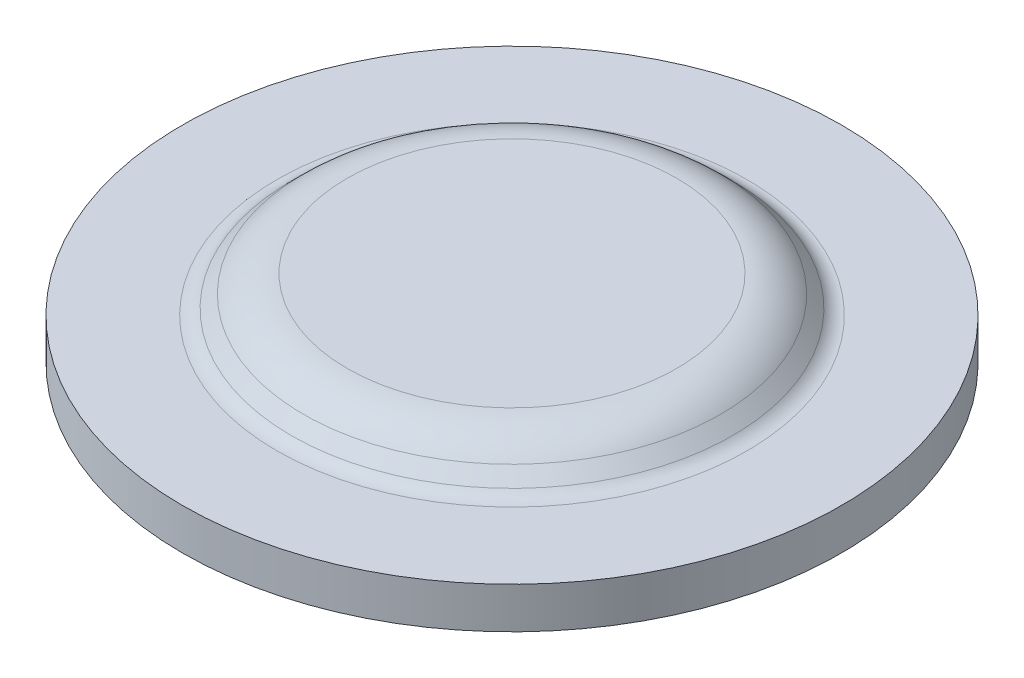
ISO-10303-21;
HEADER;
FILE_DESCRIPTION(('STEP AP214'),'2;1');
FILE_NAME('part.step','',(''),(''),'','','');
FILE_SCHEMA(('AUTOMOTIVE_DESIGN { 1 0 10303 214 1 1 1 1 }'));
ENDSEC;
DATA;
#1=APPLICATION_CONTEXT('core data for automotive mechanical design processes');
#2=APPLICATION_PROTOCOL_DEFINITION('international standard','automotive_design',2000,#1);
#3=PRODUCT_CONTEXT('',#1,'mechanical');
#4=PRODUCT('Part','Part','',(#3));
#5=PRODUCT_RELATED_PRODUCT_CATEGORY('part','',(#4));
#6=PRODUCT_DEFINITION_FORMATION('','',#4);
#7=PRODUCT_DEFINITION_CONTEXT('part definition',#1,'design');
#8=PRODUCT_DEFINITION('design','',#6,#7);
#9=PRODUCT_DEFINITION_SHAPE('','',#8);
#10=(LENGTH_UNIT() NAMED_UNIT(*) SI_UNIT(.MILLI.,.METRE.));
#11=(NAMED_UNIT(*) PLANE_ANGLE_UNIT() SI_UNIT($,.RADIAN.));
#12=(NAMED_UNIT(*) SI_UNIT($,.STERADIAN.) SOLID_ANGLE_UNIT());
#13=UNCERTAINTY_MEASURE_WITH_UNIT(LENGTH_MEASURE(1.E-05),#10,'distance_accuracy_value','');
#14=(GEOMETRIC_REPRESENTATION_CONTEXT(3) GLOBAL_UNCERTAINTY_ASSIGNED_CONTEXT((#13)) GLOBAL_UNIT_ASSIGNED_CONTEXT((#10,
#11,#12)) REPRESENTATION_CONTEXT('',''));
#15=CARTESIAN_POINT('',(0.,0.,0.));
#16=DIRECTION('',(0.,0.,1.));
#17=DIRECTION('',(1.,0.,0.));
#18=AXIS2_PLACEMENT_3D('',#15,#16,#17);
#19=CARTESIAN_POINT('',(0.,0.,0.));
#20=DIRECTION('',(0.,-1.,0.));
#21=DIRECTION('',(0.,0.,-1.));
#22=AXIS2_PLACEMENT_3D('',#19,#20,#21);
#23=PLANE('',#22);
#24=CARTESIAN_POINT('',(0.,0.,0.));
#25=DIRECTION('',(0.,1.,0.));
#26=DIRECTION('',(-1.,0.,0.));
#27=AXIS2_PLACEMENT_3D('',#24,#25,#26);
#28=CIRCLE('',#27,12.7);
#29=CARTESIAN_POINT('',(0.,0.,-12.7));
#30=VERTEX_POINT('',#29);
#31=CARTESIAN_POINT('',(0.,0.,12.7));
#32=VERTEX_POINT('',#31);
#33=EDGE_CURVE('E23',#30,#32,#28,.F.);
#34=ORIENTED_EDGE('',*,*,#33,.F.);
#35=CARTESIAN_POINT('',(0.,0.,12.7));
#36=CARTESIAN_POINT('',(-0.184824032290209,-3.84965216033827E-09,12.7000244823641));
#37=CARTESIAN_POINT('',(-0.36963106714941,-1.68045533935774E-09,12.6959965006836));
#38=CARTESIAN_POINT('',(-0.738898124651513,9.47294713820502E-10,12.6799204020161));
#39=CARTESIAN_POINT('',(-0.923358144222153,1.40583287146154E-09,12.667872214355));
#40=CARTESIAN_POINT('',(-1.33764169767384,-1.4954067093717E-08,12.6318369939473));
#41=CARTESIAN_POINT('',(-1.56727870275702,-3.61199058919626E-08,12.6056184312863));
#42=CARTESIAN_POINT('',(-1.88459083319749,-4.27500474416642E-08,12.5603596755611));
#43=CARTESIAN_POINT('',(-1.97307076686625,-4.21408398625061E-08,12.5467582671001));
#44=CARTESIAN_POINT('',(-2.26868301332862,-3.46277801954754E-08,12.4980667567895));
#45=CARTESIAN_POINT('',(-2.47512819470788,-2.03514395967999E-08,12.458706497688));
#46=CARTESIAN_POINT('',(-2.91330756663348,-2.42009717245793E-09,12.3638436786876));
#47=CARTESIAN_POINT('',(-3.1447285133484,-4.42313466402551E-10,12.3068857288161));
#48=CARTESIAN_POINT('',(-3.43502549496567,2.44823947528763E-11,12.2268096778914));
#49=CARTESIAN_POINT('',(-3.49557710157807,9.72734467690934E-12,12.2096267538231));
#50=CARTESIAN_POINT('',(-3.66844496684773,-1.81121848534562E-11,12.1591972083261));
#51=CARTESIAN_POINT('',(-3.78044419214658,-1.88209919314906E-11,12.124857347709));
#52=CARTESIAN_POINT('',(-4.11494347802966,-5.82007553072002E-11,12.0171976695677));
#53=CARTESIAN_POINT('',(-4.33596647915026,-1.34118184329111E-10,11.9392321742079));
#54=CARTESIAN_POINT('',(-4.77335162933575,-2.65208325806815E-10,11.7712032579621));
#55=CARTESIAN_POINT('',(-4.98971377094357,-3.20381005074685E-10,11.6811398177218));
#56=CARTESIAN_POINT('',(-5.4171260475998,-3.89526845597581E-10,11.4891770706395));
#57=CARTESIAN_POINT('',(-5.62817617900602,-4.03499978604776E-10,11.3872777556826));
#58=CARTESIAN_POINT('',(-6.04431517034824,-3.7917256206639E-10,11.1719584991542));
#59=CARTESIAN_POINT('',(-6.24940403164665,-3.40872024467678E-10,11.0585385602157));
#60=CARTESIAN_POINT('',(-6.65299016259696,-2.34154174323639E-10,10.8205275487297));
#61=CARTESIAN_POINT('',(-6.85148743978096,-1.65736896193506E-10,10.6959364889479));
#62=CARTESIAN_POINT('',(-7.24129202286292,-4.90150512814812E-11,10.4359543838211));
#63=CARTESIAN_POINT('',(-7.43259934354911,-7.10443129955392E-13,10.3005633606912));
#64=CARTESIAN_POINT('',(-7.72922997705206,4.08603384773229E-13,10.0780700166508));
#65=CARTESIAN_POINT('',(-7.83713271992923,-1.53499500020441E-11,9.99438280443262));
#66=CARTESIAN_POINT('',(-8.05018994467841,-3.35935319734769E-11,9.82357444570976));
#67=CARTESIAN_POINT('',(-8.15534442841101,-3.60785695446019E-11,9.73645330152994));
#68=CARTESIAN_POINT('',(-8.36279163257,-2.46835874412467E-11,9.55886880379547));
#69=CARTESIAN_POINT('',(-8.46508435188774,-1.08035614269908E-11,9.46840544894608));
#70=CARTESIAN_POINT('',(-8.66670151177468,5.04949516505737E-12,9.28423122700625));
#71=CARTESIAN_POINT('',(-8.76602594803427,7.0225084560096E-12,9.19052035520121));
#72=CARTESIAN_POINT('',(-8.98116596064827,-1.01463956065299E-10,8.98088773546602));
#73=CARTESIAN_POINT('',(-9.09630723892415,-2.34486653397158E-10,8.86427195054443));
#74=CARTESIAN_POINT('',(-9.28977013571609,-6.71658310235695E-10,8.66059653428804));
#75=CARTESIAN_POINT('',(-9.36921913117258,-9.16112779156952E-10,8.57460328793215));
#76=CARTESIAN_POINT('',(-9.54526865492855,-1.44522386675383E-09,8.37867868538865));
#77=CARTESIAN_POINT('',(-9.64119193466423,-1.72465418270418E-09,8.26813701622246));
#78=CARTESIAN_POINT('',(-9.82915599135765,-2.17631259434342E-09,8.04380283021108));
#79=CARTESIAN_POINT('',(-9.92119676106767,-2.3485404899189E-09,7.93001030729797));
#80=CARTESIAN_POINT('',(-10.1012868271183,-2.52647142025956E-09,7.69930866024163));
#81=CARTESIAN_POINT('',(-10.1893361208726,-2.53217434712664E-09,7.58239953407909));
#82=CARTESIAN_POINT('',(-10.3613374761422,-2.37841325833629E-09,7.34560540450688));
#83=CARTESIAN_POINT('',(-10.4452895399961,-2.21894933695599E-09,7.22572040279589));
#84=CARTESIAN_POINT('',(-10.6089954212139,-1.77789731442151E-09,6.98311781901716));
#85=CARTESIAN_POINT('',(-10.6887492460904,-1.4963094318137E-09,6.86040024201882));
#86=CARTESIAN_POINT('',(-10.8439649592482,-9.29882612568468E-10,6.61228047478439));
#87=CARTESIAN_POINT('',(-10.9194268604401,-6.45043685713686E-10,6.4868782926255));
#88=CARTESIAN_POINT('',(-11.0659612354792,-1.49235200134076E-10,6.23353643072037));
#89=CARTESIAN_POINT('',(-11.1370337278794,6.17346708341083E-11,6.10559676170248));
#90=CARTESIAN_POINT('',(-11.2797927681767,-6.62806330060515E-11,5.83785098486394));
#91=CARTESIAN_POINT('',(-11.3511402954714,-4.46839166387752E-10,5.69786399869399));
#92=CARTESIAN_POINT('',(-11.4972078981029,4.17609017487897E-10,5.39769478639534));
#93=CARTESIAN_POINT('',(-11.5712349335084,1.8717342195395E-09,5.23717525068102));
#94=CARTESIAN_POINT('',(-11.7126344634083,-3.55651405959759E-09,4.91321954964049));
#95=CARTESIAN_POINT('',(-11.7800068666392,-1.04390018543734E-08,4.7497833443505));
#96=CARTESIAN_POINT('',(-11.8731237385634,-1.26514081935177E-08,4.50937135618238));
#97=CARTESIAN_POINT('',(-11.9016656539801,-1.2217502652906E-08,4.43346857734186));
#98=CARTESIAN_POINT('',(-11.9890652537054,-9.48539449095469E-09,4.19404982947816));
#99=CARTESIAN_POINT('',(-12.0452833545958,-5.6231270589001E-09,4.02955988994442));
#100=CARTESIAN_POINT('',(-12.145707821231,-1.25640466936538E-09,3.7147667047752));
#101=CARTESIAN_POINT('',(-12.1905521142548,-4.58078057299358E-10,3.56466621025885));
#102=CARTESIAN_POINT('',(-12.2592720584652,1.40692521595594E-11,3.31821778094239));
#103=CARTESIAN_POINT('',(-12.2848095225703,-7.22942656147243E-12,3.2223295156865));
#104=CARTESIAN_POINT('',(-12.3590516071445,1.47379253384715E-11,2.92994959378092));
#105=CARTESIAN_POINT('',(-12.4042269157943,1.48194567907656E-10,2.73254920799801));
#106=CARTESIAN_POINT('',(-12.4851083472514,-1.23484726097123E-09,2.33581239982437));
#107=CARTESIAN_POINT('',(-12.5208143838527,-2.75136075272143E-09,2.13647595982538));
#108=CARTESIAN_POINT('',(-12.561024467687,-6.87540143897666E-09,1.87640153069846));
#109=CARTESIAN_POINT('',(-12.5698744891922,-7.9762197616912E-09,1.81631544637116));
#110=CARTESIAN_POINT('',(-12.5867245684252,-1.16176603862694E-08,1.69602269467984));
#111=CARTESIAN_POINT('',(-12.5947246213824,-1.41582907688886E-08,1.63581602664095));
#112=CARTESIAN_POINT('',(-12.6132680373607,-1.69818757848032E-08,1.48779986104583));
#113=CARTESIAN_POINT('',(-12.6233068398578,-1.57062613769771E-08,1.39992726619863));
#114=CARTESIAN_POINT('',(-12.650384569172,-1.1091843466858E-08,1.13859690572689));
#115=CARTESIAN_POINT('',(-12.6647599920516,-6.95224022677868E-09,0.964856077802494));
#116=CARTESIAN_POINT('',(-12.6855624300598,-1.83494198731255E-09,0.629530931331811));
#117=CARTESIAN_POINT('',(-12.6924895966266,-6.50006501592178E-10,0.46797727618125));
#118=CARTESIAN_POINT('',(-12.698789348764,4.787543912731E-11,0.204255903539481));
#119=CARTESIAN_POINT('',(-12.7000045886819,1.58644500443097E-11,0.102128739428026));
#120=CARTESIAN_POINT('',(-12.6999942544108,-1.98720390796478E-11,-0.127877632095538));
#121=CARTESIAN_POINT('',(-12.6980760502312,-1.4431354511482E-11,-0.255757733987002));
#122=CARTESIAN_POINT('',(-12.6903676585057,-3.81394548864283E-11,-0.511400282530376));
#123=CARTESIAN_POINT('',(-12.684577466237,-6.72882820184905E-11,-0.63916272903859));
#124=CARTESIAN_POINT('',(-12.6691434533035,-1.34810511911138E-10,-0.894454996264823));
#125=CARTESIAN_POINT('',(-12.6594996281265,-1.73183925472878E-10,-1.02198481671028));
#126=CARTESIAN_POINT('',(-12.6363636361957,-2.63522351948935E-10,-1.27669501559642));
#127=CARTESIAN_POINT('',(-12.6228714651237,-3.15487380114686E-10,-1.40387539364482));
#128=CARTESIAN_POINT('',(-12.5920520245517,-4.29510494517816E-10,-1.65777076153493));
#129=CARTESIAN_POINT('',(-12.5747247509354,-4.91568591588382E-10,-1.78448575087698));
#130=CARTESIAN_POINT('',(-12.5362506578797,-6.24490110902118E-10,-2.03733467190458));
#131=CARTESIAN_POINT('',(-12.515103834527,-6.95353542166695E-10,-2.16346860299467));
#132=CARTESIAN_POINT('',(-12.4690099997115,-8.44107797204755E-10,-2.41504030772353));
#133=CARTESIAN_POINT('',(-12.4440629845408,-9.21998627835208E-10,-2.54047808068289));
#134=CARTESIAN_POINT('',(-12.3903915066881,-1.08326372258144E-09,-2.79054299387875));
#135=CARTESIAN_POINT('',(-12.3616670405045,-1.16663799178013E-09,-2.91517013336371));
#136=CARTESIAN_POINT('',(-12.300466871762,-1.33736603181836E-09,-3.16350004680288));
#137=CARTESIAN_POINT('',(-12.2679911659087,-1.42471980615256E-09,-3.28720281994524));
#138=CARTESIAN_POINT('',(-12.1993181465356,-1.60199456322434E-09,-3.53357111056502));
#139=CARTESIAN_POINT('',(-12.163120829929,-1.69191554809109E-09,-3.65623662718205));
#140=CARTESIAN_POINT('',(-12.0870376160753,-1.87298983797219E-09,-3.90041846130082));
#141=CARTESIAN_POINT('',(-12.0471517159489,-1.96414314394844E-09,-4.02193477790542));
#142=CARTESIAN_POINT('',(-11.9637277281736,-2.14642991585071E-09,-4.26370731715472));
#143=CARTESIAN_POINT('',(-11.920189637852,-2.23756338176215E-09,-4.3839635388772));
#144=CARTESIAN_POINT('',(-11.8295009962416,-2.41863745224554E-09,-4.62310614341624));
#145=CARTESIAN_POINT('',(-11.7823504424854,-2.50857805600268E-09,-4.74199252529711));
#146=CARTESIAN_POINT('',(-11.6844798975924,-2.68617634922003E-09,-4.97828695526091));
#147=CARTESIAN_POINT('',(-11.6337599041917,-2.77383403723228E-09,-5.09569500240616));
#148=CARTESIAN_POINT('',(-11.5287967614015,-2.94585462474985E-09,-5.32892561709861));
#149=CARTESIAN_POINT('',(-11.4745536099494,-3.03021752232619E-09,-5.44474818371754));
#150=CARTESIAN_POINT('',(-11.3625936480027,-3.19471975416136E-09,-5.67470213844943));
#151=CARTESIAN_POINT('',(-11.3048768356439,-3.27485908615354E-09,-5.78883352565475));
#152=CARTESIAN_POINT('',(-11.1860222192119,-3.43006576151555E-09,-6.01530096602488));
#153=CARTESIAN_POINT('',(-11.1248844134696,-3.50513310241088E-09,-6.12763701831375));
#154=CARTESIAN_POINT('',(-10.9992435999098,-3.64942685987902E-09,-6.35041127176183));
#155=CARTESIAN_POINT('',(-10.9347405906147,-3.71865327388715E-09,-6.46084947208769));
#156=CARTESIAN_POINT('',(-10.8024282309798,-3.85057845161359E-09,-6.67972723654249));
#157=CARTESIAN_POINT('',(-10.7346188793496,-3.91327721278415E-09,-6.78816679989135));
#158=CARTESIAN_POINT('',(-10.5957557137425,-4.03154122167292E-09,-7.00294832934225));
#159=CARTESIAN_POINT('',(-10.5247018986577,-4.08710646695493E-09,-7.10929029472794));
#160=CARTESIAN_POINT('',(-10.3794146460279,-4.19057764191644E-09,-7.31977958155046));
#161=CARTESIAN_POINT('',(-10.3051812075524,-4.23848356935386E-09,-7.42392690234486));
#162=CARTESIAN_POINT('',(-10.1536024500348,-4.32619145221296E-09,-7.6299318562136));
#163=CARTESIAN_POINT('',(-10.0762571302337,-4.36599340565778E-09,-7.73178948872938));
#164=CARTESIAN_POINT('',(-9.91852519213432,-4.43712976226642E-09,-7.93312211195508));
#165=CARTESIAN_POINT('',(-9.83813857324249,-4.4684641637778E-09,-8.03259710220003));
#166=CARTESIAN_POINT('',(-9.67439739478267,-4.52238210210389E-09,-8.22907366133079));
#167=CARTESIAN_POINT('',(-9.59104283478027,-4.54496563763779E-09,-8.32607522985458));
#168=CARTESIAN_POINT('',(-9.42144184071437,-4.58118038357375E-09,-8.51751642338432));
#169=CARTESIAN_POINT('',(-9.3351954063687,-4.59481159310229E-09,-8.61195604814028));
#170=CARTESIAN_POINT('',(-9.15988936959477,-4.61300000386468E-09,-8.79818717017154));
#171=CARTESIAN_POINT('',(-9.07082976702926,-4.61755720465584E-09,-8.88997866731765));
#172=CARTESIAN_POINT('',(-8.88997866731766,-4.61755720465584E-09,-9.07082976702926));
#173=CARTESIAN_POINT('',(-8.79818717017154,-4.61300000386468E-09,-9.15988936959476));
#174=CARTESIAN_POINT('',(-8.61195604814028,-4.59481159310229E-09,-9.3351954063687));
#175=CARTESIAN_POINT('',(-8.51751642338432,-4.58118038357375E-09,-9.42144184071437));
#176=CARTESIAN_POINT('',(-8.32607522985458,-4.54496563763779E-09,-9.59104283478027));
#177=CARTESIAN_POINT('',(-8.22907366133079,-4.52238210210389E-09,-9.67439739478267));
#178=CARTESIAN_POINT('',(-8.03259710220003,-4.4684641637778E-09,-9.83813857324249));
#179=CARTESIAN_POINT('',(-7.93312211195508,-4.43712976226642E-09,-9.91852519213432));
#180=CARTESIAN_POINT('',(-7.73178948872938,-4.36599340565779E-09,-10.0762571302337));
#181=CARTESIAN_POINT('',(-7.6299318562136,-4.32619145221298E-09,-10.1536024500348));
#182=CARTESIAN_POINT('',(-7.42392690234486,-4.23848356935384E-09,-10.3051812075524));
#183=CARTESIAN_POINT('',(-7.31977958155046,-4.19057764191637E-09,-10.3794146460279));
#184=CARTESIAN_POINT('',(-7.10929029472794,-4.087106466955E-09,-10.5247018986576));
#185=CARTESIAN_POINT('',(-7.00294832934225,-4.03154122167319E-09,-10.5957557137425));
#186=CARTESIAN_POINT('',(-6.78816679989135,-3.91327721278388E-09,-10.7346188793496));
#187=CARTESIAN_POINT('',(-6.67972723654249,-3.85057845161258E-09,-10.8024282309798));
#188=CARTESIAN_POINT('',(-6.4608494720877,-3.71865327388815E-09,-10.9347405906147));
#189=CARTESIAN_POINT('',(-6.35041127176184,-3.64942685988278E-09,-10.9992435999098));
#190=CARTESIAN_POINT('',(-6.12763701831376,-3.50513310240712E-09,-11.1248844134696));
#191=CARTESIAN_POINT('',(-6.01530096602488,-3.43006576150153E-09,-11.1860222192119));
#192=CARTESIAN_POINT('',(-5.78883352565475,-3.27485908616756E-09,-11.3048768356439));
#193=CARTESIAN_POINT('',(-5.67470213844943,-3.19471975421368E-09,-11.3625936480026));
#194=CARTESIAN_POINT('',(-5.44474818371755,-3.03021752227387E-09,-11.4745536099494));
#195=CARTESIAN_POINT('',(-5.32892561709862,-2.94585462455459E-09,-11.5287967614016));
#196=CARTESIAN_POINT('',(-5.09569500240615,-2.77383403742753E-09,-11.6337599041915));
#197=CARTESIAN_POINT('',(-4.97828695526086,-2.68617634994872E-09,-11.6844798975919));
#198=CARTESIAN_POINT('',(-4.74199252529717,-2.50857805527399E-09,-11.7823504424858));
#199=CARTESIAN_POINT('',(-4.62310614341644,-2.41863744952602E-09,-11.8295009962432));
#200=CARTESIAN_POINT('',(-4.38396353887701,-2.23756338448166E-09,-11.9201896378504));
#201=CARTESIAN_POINT('',(-4.26370731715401,-2.14642992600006E-09,-11.9637277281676));
#202=CARTESIAN_POINT('',(-4.02193477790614,-1.96414313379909E-09,-12.0471517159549));
#203=CARTESIAN_POINT('',(-3.90041846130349,-1.87298980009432E-09,-12.0870376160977));
#204=CARTESIAN_POINT('',(-3.65623662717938,-1.69191558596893E-09,-12.1631208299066));
#205=CARTESIAN_POINT('',(-3.53357111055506,-1.60199470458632E-09,-12.1993181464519));
#206=CARTESIAN_POINT('',(-3.2872028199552,-1.4247196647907E-09,-12.2679911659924));
#207=CARTESIAN_POINT('',(-3.16350004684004,-1.33736550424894E-09,-12.3004668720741));
#208=CARTESIAN_POINT('',(-2.91517013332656,-1.16663851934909E-09,-12.3616670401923));
#209=CARTESIAN_POINT('',(-2.79054299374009,-1.08326569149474E-09,-12.390391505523));
#210=CARTESIAN_POINT('',(-2.54047808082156,-9.21996658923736E-10,-12.4440629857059));
#211=CARTESIAN_POINT('',(-2.41504030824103,-8.441004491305E-10,-12.4690100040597));
#212=CARTESIAN_POINT('',(-2.16346860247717,-6.9536089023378E-10,-12.5151038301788));
#213=CARTESIAN_POINT('',(-2.03733466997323,-6.24517534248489E-10,-12.5362506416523));
#214=CARTESIAN_POINT('',(-1.78448575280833,-4.91541168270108E-10,-12.5747247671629));
#215=CARTESIAN_POINT('',(-1.65777076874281,-4.29408149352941E-10,-12.5920520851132));
#216=CARTESIAN_POINT('',(-1.40387538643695,-3.1558972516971E-10,-12.6228714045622));
#217=CARTESIAN_POINT('',(-1.27669498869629,-2.63904308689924E-10,-12.6363634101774));
#218=CARTESIAN_POINT('',(-1.02198484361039,-1.72801969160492E-10,-12.6594998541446));
#219=CARTESIAN_POINT('',(-0.894455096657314,-1.33385032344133E-10,-12.6691442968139));
#220=CARTESIAN_POINT('',(-0.63916262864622,-6.87137599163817E-11,-12.6845766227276));
#221=CARTESIAN_POINT('',(-0.511399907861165,-4.34594077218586E-11,-12.6903645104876));
#222=CARTESIAN_POINT('',(-0.255758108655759,-9.1114081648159E-12,-12.6980791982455));
#223=CARTESIAN_POINT('',(-0.12787903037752,0.,-12.7000060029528));
#224=CARTESIAN_POINT('',(0.,0.,-12.7));
#225=B_SPLINE_CURVE_WITH_KNOTS('',3,(#35,#36,#37,#38,#39,#40,#41,#42,#43,#44,#45,#46,#47,#48,
#49,#50,#51,#52,#53,#54,#55,#56,#57,#58,#59,#60,#61,#62,#63,#64,#65,#66,#67,#68,#69,#70,#71,#72,
#73,#74,#75,#76,#77,#78,#79,#80,#81,#82,#83,#84,#85,#86,#87,#88,#89,#90,#91,#92,#93,#94,#95,#96,
#97,#98,#99,#100,#101,#102,#103,#104,#105,#106,#107,#108,#109,#110,#111,#112,#113,#114,#115,
#116,#117,#118,#119,#120,#121,#122,#123,#124,#125,#126,#127,#128,#129,#130,#131,#132,#133,#134,
#135,#136,#137,#138,#139,#140,#141,#142,#143,#144,#145,#146,#147,#148,#149,#150,#151,#152,#153,
#154,#155,#156,#157,#158,#159,#160,#161,#162,#163,#164,#165,#166,#167,#168,#169,#170,#171,#172,
#173,#174,#175,#176,#177,#178,#179,#180,#181,#182,#183,#184,#185,#186,#187,#188,#189,#190,#191,
#192,#193,#194,#195,#196,#197,#198,#199,#200,#201,#202,#203,#204,#205,#206,#207,#208,#209,#210,
#211,#212,#213,#214,#215,#216,#217,#218,#219,#220,#221,#222,#223,#224),.UNSPECIFIED.,.F.,.F.,(4,
2,2,2,2,2,2,2,2,2,2,2,2,2,2,2,2,2,2,2,2,2,2,2,2,2,2,2,2,2,2,2,2,2,2,2,2,2,2,2,2,2,2,2,2,2,2,2,2,
2,2,2,2,2,2,2,2,2,2,2,2,2,2,2,2,2,2,2,2,2,2,2,2,2,2,2,2,2,2,2,2,2,2,2,2,2,2,2,2,2,2,2,2,2,4),
(0.,0.554394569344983,1.10879402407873,1.8017774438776,2.07032301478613,2.70053911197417,
3.41510001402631,3.6039240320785,3.95531913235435,4.65804328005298,5.36076855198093,
6.06349430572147,6.76621989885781,7.4689446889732,8.17166803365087,8.58126347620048,
8.99085864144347,9.40045396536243,9.81004988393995,10.3015570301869,10.6527483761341,
11.0917308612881,11.5307141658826,11.9696977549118,12.4086810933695,12.8476636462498,
13.2866448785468,13.7256242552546,14.1968776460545,14.7270313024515,15.2571922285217,
15.500457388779,16.0217882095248,16.4916474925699,16.7893188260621,17.3965865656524,
18.0038598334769,18.1860592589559,18.3682597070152,18.6335746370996,19.1564175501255,
19.6414031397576,19.9477810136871,20.3314034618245,20.715026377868,21.0986497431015,
21.4822735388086,21.8658977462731,22.2495223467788,22.6331473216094,23.0167726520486,
23.4003983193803,23.7840243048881,24.1676505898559,24.5512771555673,24.9349039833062,
25.3185310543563,25.7021583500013,26.085785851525,26.4694135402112,26.8530413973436,
27.236669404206,27.620297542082,28.0039257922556,28.3875541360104,28.7711825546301,
29.1548110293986,29.5384395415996,29.9220680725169,30.3056966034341,30.6893251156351,
31.0729535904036,31.4565820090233,31.8402103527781,32.2238386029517,32.6074667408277,
32.9910947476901,33.3747226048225,33.7583502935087,34.1419777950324,34.5256050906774,
34.9092321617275,35.2928589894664,35.6764855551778,36.0601118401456,36.4437378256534,
36.8273634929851,37.2109888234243,37.5946137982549,37.9782383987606,38.3618626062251,
38.7454864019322,39.1291097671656,39.5127326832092,39.8963551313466),.UNSPECIFIED.);
#226=EDGE_CURVE('E44',#32,#30,#225,.T.);
#227=ORIENTED_EDGE('',*,*,#226,.F.);
#228=EDGE_LOOP('',(#34,#227));
#229=FACE_BOUND('',#228,.T.);
#230=ADVANCED_FACE('F18',(#229),#23,.F.);
#231=CARTESIAN_POINT('',(0.,-4.7498,0.));
#232=DIRECTION('',(0.,1.,0.));
#233=DIRECTION('',(-1.,0.,0.));
#234=AXIS2_PLACEMENT_3D('',#231,#232,#233);
#235=TOROIDAL_SURFACE('',#234,12.7,4.7498);
#236=CARTESIAN_POINT('',(0.,-1.39118421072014,0.));
#237=DIRECTION('',(0.,-1.,0.));
#238=DIRECTION('',(0.,0.,-1.));
#239=AXIS2_PLACEMENT_3D('',#236,#237,#238);
#240=CIRCLE('',#239,16.0586157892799);
#241=CARTESIAN_POINT('',(0.,-1.39118421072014,-16.0586157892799));
#242=VERTEX_POINT('',#241);
#243=EDGE_CURVE('E48',#242,#242,#240,.T.);
#244=ORIENTED_EDGE('',*,*,#243,.F.);
#245=EDGE_LOOP('',(#244));
#246=FACE_BOUND('',#245,.T.);
#247=ORIENTED_EDGE('',*,*,#226,.T.);
#248=ORIENTED_EDGE('',*,*,#33,.T.);
#249=EDGE_LOOP('',(#247,#248));
#250=FACE_BOUND('',#249,.T.);
#251=ADVANCED_FACE('F46',(#246,#250),#235,.T.);
#252=CARTESIAN_POINT('',(0.,-3.175,0.));
#253=DIRECTION('',(0.,1.,0.));
#254=DIRECTION('',(0.,0.,1.));
#255=AXIS2_PLACEMENT_3D('',#252,#253,#254);
#256=PLANE('',#255);
#257=CARTESIAN_POINT('',(0.,-3.175,0.));
#258=DIRECTION('',(0.,1.,0.));
#259=DIRECTION('',(0.,0.,1.));
#260=AXIS2_PLACEMENT_3D('',#257,#258,#259);
#261=CIRCLE('',#260,12.7);
#262=CARTESIAN_POINT('',(0.,-3.175,12.7));
#263=VERTEX_POINT('',#262);
#264=EDGE_CURVE('E51',#263,#263,#261,.F.);
#265=ORIENTED_EDGE('',*,*,#264,.T.);
#266=EDGE_LOOP('',(#265));
#267=FACE_BOUND('',#266,.T.);
#268=ADVANCED_FACE('F67',(#267),#256,.F.);
#269=CARTESIAN_POINT('',(0.,-2.33275175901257,0.));
#270=DIRECTION('',(0.,-1.,0.));
#271=DIRECTION('',(0.,0.,-1.));
#272=AXIS2_PLACEMENT_3D('',#269,#270,#271);
#273=CONICAL_SURFACE('',#272,17.0001833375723,0.785398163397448);
#274=ORIENTED_EDGE('',*,*,#243,.T.);
#275=EDGE_LOOP('',(#274));
#276=FACE_BOUND('',#275,.T.);
#277=CARTESIAN_POINT('',(0.,-2.33275175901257,0.));
#278=DIRECTION('',(0.,1.,0.));
#279=DIRECTION('',(0.,0.,-1.));
#280=AXIS2_PLACEMENT_3D('',#277,#278,#279);
#281=CIRCLE('',#280,17.0001833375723);
#282=CARTESIAN_POINT('',(0.,-2.33275175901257,-17.0001833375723));
#283=VERTEX_POINT('',#282);
#284=EDGE_CURVE('E110',#283,#283,#281,.T.);
#285=ORIENTED_EDGE('',*,*,#284,.T.);
#286=EDGE_LOOP('',(#285));
#287=FACE_BOUND('',#286,.T.);
#288=ADVANCED_FACE('F73',(#276,#287),#273,.T.);
#289=CARTESIAN_POINT('',(0.,-4.7498,0.));
#290=DIRECTION('',(0.,1.,0.));
#291=DIRECTION('',(0.,0.,1.));
#292=AXIS2_PLACEMENT_3D('',#289,#290,#291);
#293=TOROIDAL_SURFACE('',#292,12.7,1.5748);
#294=ORIENTED_EDGE('',*,*,#264,.F.);
#295=EDGE_LOOP('',(#294));
#296=FACE_BOUND('',#295,.T.);
#297=CARTESIAN_POINT('',(0.,-3.63624824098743,0.));
#298=DIRECTION('',(0.,-1.,0.));
#299=DIRECTION('',(0.,0.,-1.));
#300=AXIS2_PLACEMENT_3D('',#297,#298,#299);
#301=CIRCLE('',#300,13.8135517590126);
#302=CARTESIAN_POINT('',(0.,-3.63624824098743,-13.8135517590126));
#303=VERTEX_POINT('',#302);
#304=EDGE_CURVE('E112',#303,#303,#301,.T.);
#305=ORIENTED_EDGE('',*,*,#304,.T.);
#306=EDGE_LOOP('',(#305));
#307=FACE_BOUND('',#306,.T.);
#308=ADVANCED_FACE('F70',(#296,#307),#293,.F.);
#309=CARTESIAN_POINT('',(0.,-1.21920000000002,0.));
#310=DIRECTION('',(0.,1.,0.));
#311=DIRECTION('',(0.,0.,1.));
#312=AXIS2_PLACEMENT_3D('',#309,#310,#311);
#313=TOROIDAL_SURFACE('',#312,18.1137350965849,1.57479999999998);
#314=CARTESIAN_POINT('',(0.,-2.794,0.));
#315=DIRECTION('',(0.,1.,0.));
#316=DIRECTION('',(0.,0.,1.));
#317=AXIS2_PLACEMENT_3D('',#314,#315,#316);
#318=CIRCLE('',#317,18.1137350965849);
#319=CARTESIAN_POINT('',(0.,-2.794,18.1137350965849));
#320=VERTEX_POINT('',#319);
#321=EDGE_CURVE('E114',#320,#320,#318,.T.);
#322=ORIENTED_EDGE('',*,*,#321,.T.);
#323=EDGE_LOOP('',(#322));
#324=FACE_BOUND('',#323,.T.);
#325=ORIENTED_EDGE('',*,*,#284,.F.);
#326=EDGE_LOOP('',(#325));
#327=FACE_BOUND('',#326,.T.);
#328=ADVANCED_FACE('F72',(#324,#327),#313,.F.);
#329=CARTESIAN_POINT('',(0.,-4.57781578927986,0.));
#330=DIRECTION('',(0.,-1.,0.));
#331=DIRECTION('',(0.,0.,-1.));
#332=AXIS2_PLACEMENT_3D('',#329,#330,#331);
#333=CONICAL_SURFACE('',#332,14.755119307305,0.785398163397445);
#334=CARTESIAN_POINT('',(0.,-4.57781578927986,0.));
#335=DIRECTION('',(0.,1.,0.));
#336=DIRECTION('',(0.,0.,-1.));
#337=AXIS2_PLACEMENT_3D('',#334,#335,#336);
#338=CIRCLE('',#337,14.755119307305);
#339=CARTESIAN_POINT('',(0.,-4.57781578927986,-14.755119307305));
#340=VERTEX_POINT('',#339);
#341=EDGE_CURVE('E116',#340,#340,#338,.T.);
#342=ORIENTED_EDGE('',*,*,#341,.F.);
#343=EDGE_LOOP('',(#342));
#344=FACE_BOUND('',#343,.T.);
#345=ORIENTED_EDGE('',*,*,#304,.F.);
#346=EDGE_LOOP('',(#345));
#347=FACE_BOUND('',#346,.T.);
#348=ADVANCED_FACE('F76',(#344,#347),#333,.F.);
#349=CARTESIAN_POINT('',(18.1137350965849,-2.794,0.));
#350=DIRECTION('',(0.,-1.,0.));
#351=DIRECTION('',(0.,0.,-1.));
#352=AXIS2_PLACEMENT_3D('',#349,#350,#351);
#353=PLANE('',#352);
#354=CARTESIAN_POINT('',(0.,-2.794,0.));
#355=DIRECTION('',(0.,1.,0.));
#356=DIRECTION('',(0.,0.,1.));
#357=AXIS2_PLACEMENT_3D('',#354,#355,#356);
#358=CIRCLE('',#357,25.4);
#359=CARTESIAN_POINT('',(0.,-2.794,25.4));
#360=VERTEX_POINT('',#359);
#361=EDGE_CURVE('E117',#360,#360,#358,.F.);
#362=ORIENTED_EDGE('',*,*,#361,.F.);
#363=EDGE_LOOP('',(#362));
#364=FACE_BOUND('',#363,.T.);
#365=ORIENTED_EDGE('',*,*,#321,.F.);
#366=EDGE_LOOP('',(#365));
#367=FACE_BOUND('',#366,.T.);
#368=ADVANCED_FACE('F82',(#364,#367),#353,.F.);
#369=CARTESIAN_POINT('',(0.,-1.21920000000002,0.));
#370=DIRECTION('',(0.,1.,0.));
#371=DIRECTION('',(-1.,0.,0.));
#372=AXIS2_PLACEMENT_3D('',#369,#370,#371);
#373=TOROIDAL_SURFACE('',#372,18.1137350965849,4.74979999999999);
#374=ORIENTED_EDGE('',*,*,#341,.T.);
#375=EDGE_LOOP('',(#374));
#376=FACE_BOUND('',#375,.T.);
#377=CARTESIAN_POINT('',(0.,-5.969,18.1137350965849));
#378=CARTESIAN_POINT('',(-0.242837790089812,-5.969,18.1137379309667));
#379=CARTESIAN_POINT('',(-0.485675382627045,-5.969,18.10885187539));
#380=CARTESIAN_POINT('',(-0.97095792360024,-5.969,18.0893223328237));
#381=CARTESIAN_POINT('',(-1.2134028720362,-5.969,18.074678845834));
#382=CARTESIAN_POINT('',(-1.69750787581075,-5.969,18.0356547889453));
#383=CARTESIAN_POINT('',(-1.93916793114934,-5.969,18.0112742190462));
#384=CARTESIAN_POINT('',(-2.42131233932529,-5.969,17.9528163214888));
#385=CARTESIAN_POINT('',(-2.66179669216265,-5.969,17.9187389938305));
#386=CARTESIAN_POINT('',(-3.14120074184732,-5.969,17.8409424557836));
#387=CARTESIAN_POINT('',(-3.38012043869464,-5.969,17.797223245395));
#388=CARTESIAN_POINT('',(-3.85600876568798,-5.969,17.7002137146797));
#389=CARTESIAN_POINT('',(-4.09297739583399,-5.969,17.646923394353));
#390=CARTESIAN_POINT('',(-4.5645803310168,-5.969,17.5308578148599));
#391=CARTESIAN_POINT('',(-4.79921463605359,-5.969,17.4680825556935));
#392=CARTESIAN_POINT('',(-5.26576943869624,-5.969,17.3331486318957));
#393=CARTESIAN_POINT('',(-5.4976899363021,-5.969,17.2609899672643));
#394=CARTESIAN_POINT('',(-5.95844203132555,-5.969,17.1074059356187));
#395=CARTESIAN_POINT('',(-6.18727362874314,-5.969,17.0259805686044));
#396=CARTESIAN_POINT('',(-6.64147782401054,-5.969,16.8539948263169));
#397=CARTESIAN_POINT('',(-6.86685042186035,-5.969,16.7634344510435));
#398=CARTESIAN_POINT('',(-7.31377212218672,-5.969,16.5733251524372));
#399=CARTESIAN_POINT('',(-7.53532122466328,-5.969,16.4737762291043));
#400=CARTESIAN_POINT('',(-7.97423758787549,-5.969,16.2658508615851));
#401=CARTESIAN_POINT('',(-8.19160484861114,-5.969,16.1574744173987));
#402=CARTESIAN_POINT('',(-8.62180607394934,-5.969,15.9320692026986));
#403=CARTESIAN_POINT('',(-8.83464003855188,-5.969,15.815040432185));
#404=CARTESIAN_POINT('',(-9.25543006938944,-5.969,15.5725201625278));
#405=CARTESIAN_POINT('',(-9.46338613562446,-5.969,15.4470286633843));
#406=CARTESIAN_POINT('',(-9.87408544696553,-5.969,15.1877846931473));
#407=CARTESIAN_POINT('',(-10.0768286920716,-5.969,15.0540322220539));
#408=CARTESIAN_POINT('',(-10.4767691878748,-5.969,14.7784871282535));
#409=CARTESIAN_POINT('',(-10.6739664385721,-5.969,14.6366945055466));
#410=CARTESIAN_POINT('',(-11.1322928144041,-5.96900000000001,14.2929486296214));
#411=CARTESIAN_POINT('',(-11.390945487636,-5.96900000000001,14.0876790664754));
#412=CARTESIAN_POINT('',(-11.8966404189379,-5.969,13.6633198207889));
#413=CARTESIAN_POINT('',(-12.143682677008,-5.96899999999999,13.4442301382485));
#414=CARTESIAN_POINT('',(-12.6254292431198,-5.96900000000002,12.9928780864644));
#415=CARTESIAN_POINT('',(-12.8601335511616,-5.96900000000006,12.7606157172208));
#416=CARTESIAN_POINT('',(-13.3165001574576,-5.96899999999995,12.2836140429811));
#417=CARTESIAN_POINT('',(-13.5381624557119,-5.96899999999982,12.0388747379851));
#418=CARTESIAN_POINT('',(-13.9677834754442,-5.96900000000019,11.537650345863));
#419=CARTESIAN_POINT('',(-14.1757421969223,-5.96900000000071,11.2811652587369));
#420=CARTESIAN_POINT('',(-14.5773347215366,-5.9689999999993,10.7572140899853));
#421=CARTESIAN_POINT('',(-14.7709685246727,-5.96899999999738,10.4897480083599));
#422=CARTESIAN_POINT('',(-15.1433320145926,-5.96900000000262,9.94464016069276));
#423=CARTESIAN_POINT('',(-15.3220617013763,-5.96900000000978,9.66699839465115));
#424=CARTESIAN_POINT('',(-15.6640856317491,-5.96899999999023,9.10234549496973));
#425=CARTESIAN_POINT('',(-15.8273798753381,-5.96899999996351,8.81533436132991));
#426=CARTESIAN_POINT('',(-16.0683876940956,-5.96900000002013,8.36346867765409));
#427=CARTESIAN_POINT('',(-16.1516438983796,-5.9690000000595,8.20154493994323));
#428=CARTESIAN_POINT('',(-16.3132615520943,-5.96899999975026,7.87526652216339));
#429=CARTESIAN_POINT('',(-16.3916229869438,-5.96899999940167,7.71091183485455));
#430=CARTESIAN_POINT('',(-16.5433700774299,-5.96899999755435,7.37992157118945));
#431=CARTESIAN_POINT('',(-16.6167557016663,-5.96899999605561,7.21328598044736));
#432=CARTESIAN_POINT('',(-16.7584990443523,-5.96899998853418,6.87788758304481));
#433=CARTESIAN_POINT('',(-16.8268567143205,-5.96899998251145,6.70912475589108));
#434=CARTESIAN_POINT('',(-16.9584529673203,-5.96899996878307,6.36956577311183));
#435=CARTESIAN_POINT('',(-17.0216902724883,-5.96899996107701,6.19876912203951));
#436=CARTESIAN_POINT('',(-17.1429110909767,-5.96899995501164,5.8553213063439));
#437=CARTESIAN_POINT('',(-17.200894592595,-5.96899995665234,5.68267013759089));
#438=CARTESIAN_POINT('',(-17.3116024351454,-5.96899996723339,5.33569077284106));
#439=CARTESIAN_POINT('',(-17.3643268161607,-5.96899997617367,5.16136258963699));
#440=CARTESIAN_POINT('',(-17.4643276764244,-5.96899999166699,4.81115259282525));
#441=CARTESIAN_POINT('',(-17.5116042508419,-5.96899999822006,4.63527080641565));
#442=CARTESIAN_POINT('',(-17.5823775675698,-5.96900000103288,4.35634215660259));
#443=CARTESIAN_POINT('',(-17.6075267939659,-5.9690000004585,4.25370881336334));
#444=CARTESIAN_POINT('',(-17.6938308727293,-5.96899999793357,3.88766684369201));
#445=CARTESIAN_POINT('',(-17.7499945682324,-5.96899999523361,3.62305497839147));
#446=CARTESIAN_POINT('',(-17.8376529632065,-5.96899998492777,3.15913910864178));
#447=CARTESIAN_POINT('',(-17.8717896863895,-5.96899997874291,2.96032654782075));
#448=CARTESIAN_POINT('',(-17.9289724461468,-5.96899997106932,2.5900426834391));
#449=CARTESIAN_POINT('',(-17.9529055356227,-5.96899996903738,2.41870850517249));
#450=CARTESIAN_POINT('',(-17.9976560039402,-5.96899996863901,2.06077624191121));
#451=CARTESIAN_POINT('',(-18.0180333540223,-5.9689999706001,1.87412302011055));
#452=CARTESIAN_POINT('',(-18.0529529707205,-5.968999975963,1.50027304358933));
#453=CARTESIAN_POINT('',(-18.0674952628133,-5.96899997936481,1.31307629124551));
#454=CARTESIAN_POINT('',(-18.0907503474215,-5.9689999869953,0.938322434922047));
#455=CARTESIAN_POINT('',(-18.0994631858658,-5.96899999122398,0.750765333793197));
#456=CARTESIAN_POINT('',(-18.1109604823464,-5.96899999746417,0.375469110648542));
#457=CARTESIAN_POINT('',(-18.1137450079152,-5.96899999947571,0.187729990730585));
#458=CARTESIAN_POINT('',(-18.113728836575,-5.96900000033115,-0.118570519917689));
#459=CARTESIAN_POINT('',(-18.1126078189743,-5.969000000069,-0.237137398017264));
#460=CARTESIAN_POINT('',(-18.1043196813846,-5.96899999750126,-0.666710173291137));
#461=CARTESIAN_POINT('',(-18.0902914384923,-5.96899999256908,-0.977627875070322));
#462=CARTESIAN_POINT('',(-18.0562968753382,-5.9689999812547,-1.45653459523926));
#463=CARTESIAN_POINT('',(-18.0419678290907,-5.96899997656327,-1.62495391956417));
#464=CARTESIAN_POINT('',(-18.0095725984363,-5.96899997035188,-1.95120280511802));
#465=CARTESIAN_POINT('',(-17.9917833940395,-5.96899996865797,-2.10905937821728));
#466=CARTESIAN_POINT('',(-17.9593588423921,-5.96899996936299,-2.36609775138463));
#467=CARTESIAN_POINT('',(-17.9459811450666,-5.96899997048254,-2.46544111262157));
#468=CARTESIAN_POINT('',(-17.8940239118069,-5.96899997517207,-2.82841198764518));
#469=CARTESIAN_POINT('',(-17.850434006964,-5.96899997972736,-3.09133586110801));
#470=CARTESIAN_POINT('',(-17.7319557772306,-5.96899998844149,-3.7197484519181));
#471=CARTESIAN_POINT('',(-17.6515220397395,-5.96899999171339,-4.08420825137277));
#472=CARTESIAN_POINT('',(-17.507561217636,-5.96899999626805,-4.65242336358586));
#473=CARTESIAN_POINT('',(-17.4515590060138,-5.96899999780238,-4.85811906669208));
#474=CARTESIAN_POINT('',(-17.3483776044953,-5.96899999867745,-5.21243674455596));
#475=CARTESIAN_POINT('',(-17.3028701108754,-5.96899999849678,-5.3615455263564));
#476=CARTESIAN_POINT('',(-17.2069253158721,-5.96899999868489,-5.66208464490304));
#477=CARTESIAN_POINT('',(-17.1563964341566,-5.96899999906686,-5.81348572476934));
#478=CARTESIAN_POINT('',(-17.0514410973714,-5.96899998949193,-6.11493534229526));
#479=CARTESIAN_POINT('',(-16.9970146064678,-5.96899997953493,-6.26498386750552));
#480=CARTESIAN_POINT('',(-16.887028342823,-5.96899997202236,-6.55573264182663));
#481=CARTESIAN_POINT('',(-16.8316763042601,-5.96899997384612,-6.69651175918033));
#482=CARTESIAN_POINT('',(-16.6523571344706,-5.96899998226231,-7.1362202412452));
#483=CARTESIAN_POINT('',(-16.5220625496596,-5.96899999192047,-7.43260242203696));
#484=CARTESIAN_POINT('',(-16.2799619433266,-5.96899999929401,-7.94570931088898));
#485=CARTESIAN_POINT('',(-16.1715304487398,-5.96899999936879,-8.16403898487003));
#486=CARTESIAN_POINT('',(-15.9624433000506,-5.96899999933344,-8.56468067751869));
#487=CARTESIAN_POINT('',(-15.8629581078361,-5.96899999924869,-8.74760384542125));
#488=CARTESIAN_POINT('',(-15.6425043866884,-5.96899999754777,-9.13686607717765));
#489=CARTESIAN_POINT('',(-15.5205408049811,-5.96899999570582,-9.34264336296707));
#490=CARTESIAN_POINT('',(-15.3180140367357,-5.96899999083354,-9.66942161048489));
#491=CARTESIAN_POINT('',(-15.2399863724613,-5.96899998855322,-9.79200175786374));
#492=CARTESIAN_POINT('',(-15.0809933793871,-5.96899998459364,-10.0352405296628));
#493=CARTESIAN_POINT('',(-15.0000280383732,-5.96899998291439,-10.1558991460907));
#494=CARTESIAN_POINT('',(-14.7253334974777,-5.96899997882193,-10.5547685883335));
#495=CARTESIAN_POINT('',(-14.5251655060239,-5.96899997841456,-10.8285851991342));
#496=CARTESIAN_POINT('',(-14.1097424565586,-5.96899998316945,-11.3645115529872));
#497=CARTESIAN_POINT('',(-13.8944874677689,-5.96899998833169,-11.6266213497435));
#498=CARTESIAN_POINT('',(-13.5448996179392,-5.96899999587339,-12.0286270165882));
#499=CARTESIAN_POINT('',(-13.4154178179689,-5.96899999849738,-12.1727622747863));
#500=CARTESIAN_POINT('',(-13.2508574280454,-5.96899999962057,-12.350173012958));
#501=CARTESIAN_POINT('',(-13.2178978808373,-5.96899999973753,-12.3854244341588));
#502=CARTESIAN_POINT('',(-13.0409795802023,-5.96900000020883,-12.5731511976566));
#503=CARTESIAN_POINT('',(-12.8945261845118,-5.96900000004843,-12.7232979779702));
#504=CARTESIAN_POINT('',(-12.6347862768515,-5.96899999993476,-12.9804950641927));
#505=CARTESIAN_POINT('',(-12.5226446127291,-5.96899999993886,-13.0887076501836));
#506=CARTESIAN_POINT('',(-12.270850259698,-5.9689999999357,-13.3254890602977));
#507=CARTESIAN_POINT('',(-12.1305311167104,-5.96899999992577,-13.4533509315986));
#508=CARTESIAN_POINT('',(-11.8204695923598,-5.96899999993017,-13.7270930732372));
#509=CARTESIAN_POINT('',(-11.6499568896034,-5.96899999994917,-13.8721011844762));
#510=CARTESIAN_POINT('',(-11.2773825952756,-5.96899999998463,-14.1772353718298));
#511=CARTESIAN_POINT('',(-11.074461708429,-5.96900000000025,-14.3363139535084));
#512=CARTESIAN_POINT('',(-10.6739734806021,-5.96899999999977,-14.6366968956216));
#513=CARTESIAN_POINT('',(-10.4767775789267,-5.96899999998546,-14.7784970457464));
#514=CARTESIAN_POINT('',(-10.0768417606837,-5.96899999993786,-15.0540538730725));
#515=CARTESIAN_POINT('',(-9.87410183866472,-5.96899999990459,-15.1878105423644));
#516=CARTESIAN_POINT('',(-9.46340760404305,-5.9689999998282,-15.4470631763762));
#517=CARTESIAN_POINT('',(-9.2554532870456,-5.9689999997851,-15.5725591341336));
#518=CARTESIAN_POINT('',(-8.83466623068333,-5.96899999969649,-15.8150875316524));
#519=CARTESIAN_POINT('',(-8.62183348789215,-5.96899999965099,-15.9321199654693));
#520=CARTESIAN_POINT('',(-8.191634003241,-5.96899999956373,-16.1575319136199));
#521=CARTESIAN_POINT('',(-7.97426725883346,-5.96899999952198,-16.2659114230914));
#522=CARTESIAN_POINT('',(-7.5353513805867,-5.96899999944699,-16.4738421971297));
#523=CARTESIAN_POINT('',(-7.31380224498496,-5.96899999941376,-16.5733934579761));
#524=CARTESIAN_POINT('',(-6.86688000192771,-5.96899999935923,-16.7635066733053));
#525=CARTESIAN_POINT('',(-6.64150689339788,-5.96899999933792,-16.8540686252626));
#526=CARTESIAN_POINT('',(-6.18730129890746,-5.96899999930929,-17.0260567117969));
#527=CARTESIAN_POINT('',(-5.95846881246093,-5.96899999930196,-17.1074828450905));
#528=CARTESIAN_POINT('',(-5.49771465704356,-5.96899999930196,-17.2610675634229));
#529=CARTESIAN_POINT('',(-5.26579298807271,-5.96899999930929,-17.3332261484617));
#530=CARTESIAN_POINT('',(-4.79923566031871,-5.96899999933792,-17.4681590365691));
#531=CARTESIAN_POINT('',(-4.5646000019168,-5.96899999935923,-17.5309333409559));
#532=CARTESIAN_POINT('',(-4.09299427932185,-5.96899999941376,-17.6469961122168));
#533=CARTESIAN_POINT('',(-3.85602421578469,-5.96899999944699,-17.7002845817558));
#534=CARTESIAN_POINT('',(-3.38013304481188,-5.96899999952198,-17.7972894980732));
#535=CARTESIAN_POINT('',(-3.14121193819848,-5.96899999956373,-17.8410059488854));
#536=CARTESIAN_POINT('',(-2.66180519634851,-5.96899999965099,-17.9187960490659));
#537=CARTESIAN_POINT('',(-2.4213195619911,-5.96899999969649,-17.9528697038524));
#538=CARTESIAN_POINT('',(-1.93917282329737,-5.9689999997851,-18.0113193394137));
#539=CARTESIAN_POINT('',(-1.69751171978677,-5.9689999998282,-18.0356953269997));
#540=CARTESIAN_POINT('',(-1.21340495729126,-5.96899999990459,-18.0747093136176));
#541=CARTESIAN_POINT('',(-0.970959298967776,-5.96899999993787,-18.0893473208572));
#542=CARTESIAN_POINT('',(-0.485675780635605,-5.96899999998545,-18.1088650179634));
#543=CARTESIAN_POINT('',(-0.242837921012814,-5.96899999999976,-18.1137447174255));
#544=CARTESIAN_POINT('',(0.,-5.969,-18.1137350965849));
#545=B_SPLINE_CURVE_WITH_KNOTS('',3,(#377,#378,#379,#380,#381,#382,#383,#384,#385,#386,#387,
#388,#389,#390,#391,#392,#393,#394,#395,#396,#397,#398,#399,#400,#401,#402,#403,#404,#405,#406,
#407,#408,#409,#410,#411,#412,#413,#414,#415,#416,#417,#418,#419,#420,#421,#422,#423,#424,#425,
#426,#427,#428,#429,#430,#431,#432,#433,#434,#435,#436,#437,#438,#439,#440,#441,#442,#443,#444,
#445,#446,#447,#448,#449,#450,#451,#452,#453,#454,#455,#456,#457,#458,#459,#460,#461,#462,#463,
#464,#465,#466,#467,#468,#469,#470,#471,#472,#473,#474,#475,#476,#477,#478,#479,#480,#481,#482,
#483,#484,#485,#486,#487,#488,#489,#490,#491,#492,#493,#494,#495,#496,#497,#498,#499,#500,#501,
#502,#503,#504,#505,#506,#507,#508,#509,#510,#511,#512,#513,#514,#515,#516,#517,#518,#519,#520,
#521,#522,#523,#524,#525,#526,#527,#528,#529,#530,#531,#532,#533,#534,#535,#536,#537,#538,#539,
#540,#541,#542,#543,#544),.UNSPECIFIED.,.F.,.F.,(4,2,2,2,2,2,2,2,2,2,2,2,2,2,2,2,2,2,2,2,2,2,2,
2,2,2,2,2,2,2,2,2,2,2,2,2,2,2,2,2,2,2,2,2,2,2,2,2,2,2,2,2,2,2,2,2,2,2,2,2,2,2,2,2,2,2,2,2,2,2,2,
2,2,2,2,2,2,2,2,2,2,2,2,4),(0.,0.728463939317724,1.45692787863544,2.18539181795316,
2.91385575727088,3.64231969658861,4.37078363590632,5.09924757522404,5.82771151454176,
6.55617545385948,7.2846393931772,8.01310333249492,8.74156727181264,9.47003121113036,
10.1984951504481,10.9269590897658,11.6554230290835,12.6455275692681,13.6356321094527,
14.6257366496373,15.6158411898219,16.6059457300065,17.5960502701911,18.5861548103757,
19.5762593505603,20.1224110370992,20.6685643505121,21.2147211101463,21.7608831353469,
22.3071810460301,22.853480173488,23.3997751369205,23.9460605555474,24.2630619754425,
25.0742627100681,25.6793252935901,26.1982466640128,26.7614406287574,27.3246321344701,
27.887819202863,28.4509998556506,28.8067055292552,29.7398994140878,30.2469327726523,
30.7234357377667,31.0241460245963,31.8234256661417,32.9423209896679,33.5817534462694,
34.0493974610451,34.5281761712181,35.0069592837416,35.460730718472,36.4314723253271,
37.1626088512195,37.7871707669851,38.5045845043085,38.9404671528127,39.3763516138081,
40.3933081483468,41.4102600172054,41.9914211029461,42.1361999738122,42.7652807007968,
43.2327528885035,43.802167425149,44.4735200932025,45.246806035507,45.9752703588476,
46.7037353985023,47.4322010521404,48.1606672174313,48.8891337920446,49.6176006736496,
50.3460677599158,51.0745349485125,51.8030021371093,52.5314692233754,53.2599361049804,
53.9884026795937,54.7168688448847,55.4453344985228,56.1737995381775,56.9022638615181),.UNSPECIFIED.);
#546=CARTESIAN_POINT('',(0.,-5.969,18.1137350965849));
#547=VERTEX_POINT('',#546);
#548=CARTESIAN_POINT('',(0.,-5.969,-18.1137350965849));
#549=VERTEX_POINT('',#548);
#550=EDGE_CURVE('E29',#547,#549,#545,.T.);
#551=ORIENTED_EDGE('',*,*,#550,.T.);
#552=CARTESIAN_POINT('',(0.,-5.969,0.));
#553=DIRECTION('',(0.,1.,0.));
#554=DIRECTION('',(-1.,0.,0.));
#555=AXIS2_PLACEMENT_3D('',#552,#553,#554);
#556=CIRCLE('',#555,18.1137350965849);
#557=EDGE_CURVE('E120',#549,#547,#556,.F.);
#558=ORIENTED_EDGE('',*,*,#557,.T.);
#559=EDGE_LOOP('',(#551,#558));
#560=FACE_BOUND('',#559,.T.);
#561=ADVANCED_FACE('F20',(#376,#560),#373,.T.);
#562=CARTESIAN_POINT('',(0.,-5.97028039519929,0.));
#563=DIRECTION('',(0.,1.,0.));
#564=DIRECTION('',(0.,0.,1.));
#565=AXIS2_PLACEMENT_3D('',#562,#563,#564);
#566=CYLINDRICAL_SURFACE('',#565,25.4);
#567=ORIENTED_EDGE('',*,*,#361,.T.);
#568=EDGE_LOOP('',(#567));
#569=FACE_BOUND('',#568,.T.);
#570=CARTESIAN_POINT('',(0.,-5.969,0.));
#571=DIRECTION('',(0.,1.,0.));
#572=DIRECTION('',(0.,0.,1.));
#573=AXIS2_PLACEMENT_3D('',#570,#571,#572);
#574=CIRCLE('',#573,25.4);
#575=CARTESIAN_POINT('',(0.,-5.969,25.4));
#576=VERTEX_POINT('',#575);
#577=EDGE_CURVE('E11',#576,#576,#574,.T.);
#578=ORIENTED_EDGE('',*,*,#577,.T.);
#579=EDGE_LOOP('',(#578));
#580=FACE_BOUND('',#579,.T.);
#581=ADVANCED_FACE('F89',(#569,#580),#566,.T.);
#582=CARTESIAN_POINT('',(18.1137350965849,-5.969,0.));
#583=DIRECTION('',(0.,1.,0.));
#584=DIRECTION('',(0.,0.,1.));
#585=AXIS2_PLACEMENT_3D('',#582,#583,#584);
#586=PLANE('',#585);
#587=ORIENTED_EDGE('',*,*,#577,.F.);
#588=EDGE_LOOP('',(#587));
#589=FACE_BOUND('',#588,.T.);
#590=ORIENTED_EDGE('',*,*,#557,.F.);
#591=ORIENTED_EDGE('',*,*,#550,.F.);
#592=EDGE_LOOP('',(#590,#591));
#593=FACE_BOUND('',#592,.T.);
#594=ADVANCED_FACE('F87',(#589,#593),#586,.F.);
#595=CLOSED_SHELL('',(#230,#251,#268,#288,#308,#328,#348,#368,#561,#581,#594));
#596=MANIFOLD_SOLID_BREP('B1',#595);
#597=ADVANCED_BREP_SHAPE_REPRESENTATION('',(#18,#596),#14);
#598=SHAPE_DEFINITION_REPRESENTATION(#9,#597);
ENDSEC;
END-ISO-10303-21;
